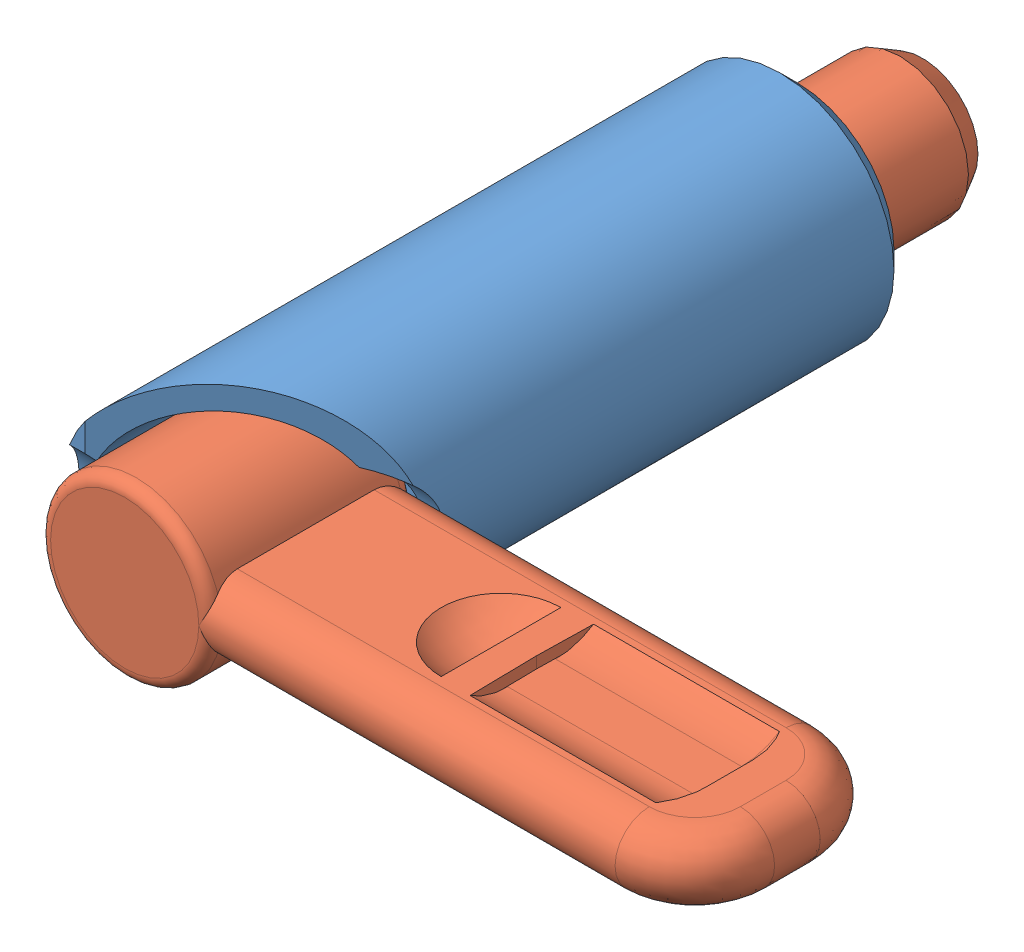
SolidWorks assembly GDX20L-12N-SUS.sldasm, configuration Default (file format 15000). Lengths in mm.
Overall size (60.01 20.01 71).
2 component instances, 2 part files, 0 mates.
Components (placement in the parent):
- GDX20L-12N-SUS_01-1: GDX20L-12N-SUS_01.SLDPRT [ﾃﾞﾌｫﾙﾄ] x (1 0 0) z (0 -1 0) size (20.02 57.18 20.01)
- GDX20L-12N-SUS_02-1: GDX20L-12N-SUS_02.SLDPRT [ﾃﾞﾌｫﾙﾄ] x (1 0 0) z (0 -1 0) size (57.5 71 15)
